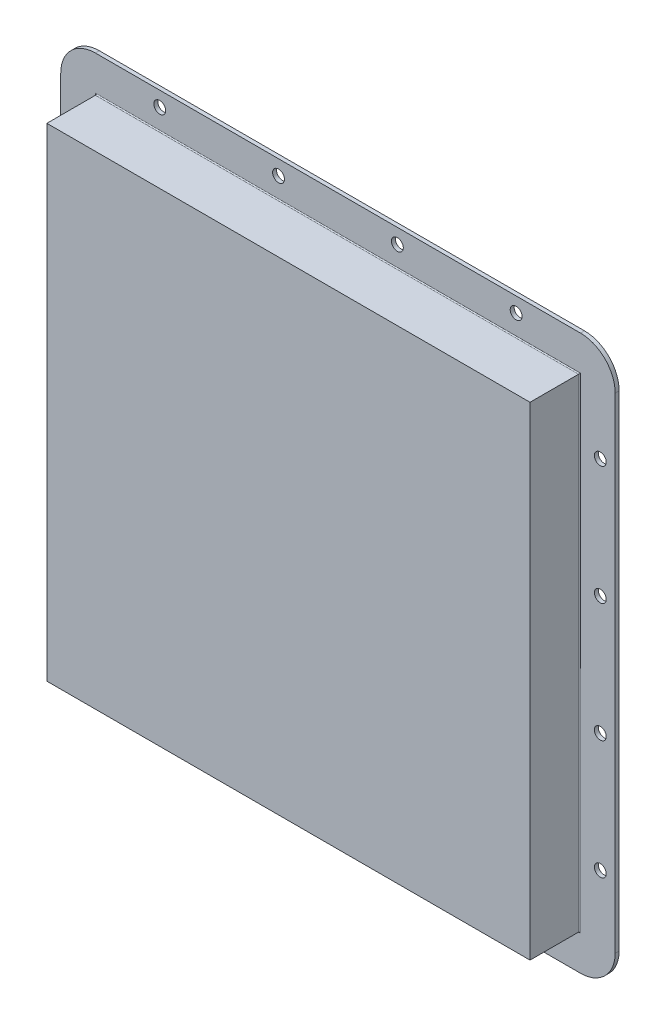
from build123d import *

# Parameters (mm, degrees)
SKETCH1_W           = 488
SKETCH1_H           = 488
BOSS_EXTRUDE1_DEPTH = 4
SKETCH2_W           = 488
SKETCH2_H           = 488
SKETCH2_W_2         = 480
SKETCH2_H_2         = 480
BOSS_EXTRUDE2_DEPTH = 50
SKETCH3_W           = 560
SKETCH3_H           = 560
SKETCH3_W_2         = 488
SKETCH3_H_2         = 488
BOSS_EXTRUDE3_DEPTH = 4
FILLET1_R           = 5
FILLET2_R           = 1
FILLET3_R           = 35
SKETCH4_R           = 6
CUT_EXTRUDE2_DEPTH  = 4
SKETCH6_R           = 5


with BuildPart() as part:
    # Sketch1 → Boss-Extrude1 (new body)
    with BuildSketch(Plane.XY):
        Rectangle(SKETCH1_W, SKETCH1_H)
    extrude(amount=BOSS_EXTRUDE1_DEPTH)

    # Sketch2 → Boss-Extrude2 (add)
    with BuildSketch(Plane(origin=(0, 0, 0), x_dir=(-1, 0, 0), z_dir=(0, 0, -1))):
        Rectangle(SKETCH2_W, SKETCH2_H)
        Rectangle(SKETCH2_W_2, SKETCH2_H_2, mode=Mode.SUBTRACT)
    extrude(amount=BOSS_EXTRUDE2_DEPTH)

    # Sketch3 → Boss-Extrude3 (add)
    with BuildSketch(Plane(origin=(0, 0, -50), x_dir=(-1, 0, 0), z_dir=(0, 0, -1))):
        Rectangle(SKETCH3_W, SKETCH3_H)
        Rectangle(SKETCH3_W_2, SKETCH3_H_2, mode=Mode.SUBTRACT)
    extrude(amount=-BOSS_EXTRUDE3_DEPTH)

    # Fillet1
    fillet1_edges = [part.edges().sort_by_distance(p)[0] for p in [
        (240, 0, -50),
        (0, -240, -50),
        (-240, 0, -50),
        (0, 240, -50),
    ]]
    fillet(fillet1_edges, radius=FILLET1_R)

    # Fillet2
    fillet2_edges = [part.edges().sort_by_distance(p)[0] for p in [
        (0, -244, -46),
        (-244, 0, -46),
        (0, 244, -46),
        (244, 0, -46),
    ]]
    fillet(fillet2_edges, radius=FILLET2_R)

    # Fillet3
    fillet3_edges = [part.edges().sort_by_distance(p)[0] for p in [
        (-280, -280, -48),
        (280, -280, -48),
        (280, 280, -48),
        (-280, 280, -48),
    ]]
    fillet(fillet3_edges, radius=FILLET3_R)

    # Sketch4 → Cut-Extrude2 (cut)
    with BuildSketch(Plane(origin=(0, 0, -50), x_dir=(-1, 0, 0), z_dir=(0, 0, -1))):
        with Locations((180, 265)):
            Circle(SKETCH4_R)
        with Locations((265, 180)):
            Circle(SKETCH4_R)
        with Locations((265, 60)):
            Circle(SKETCH4_R)
        with Locations((265, -60)):
            Circle(SKETCH4_R)
        with Locations((265, -180)):
            Circle(SKETCH4_R)
        with Locations((60, 265)):
            Circle(SKETCH4_R)
        with Locations((-60, 265)):
            Circle(SKETCH4_R)
        with Locations((-180, 265)):
            Circle(SKETCH4_R)
        with Locations((-180, -265)):
            Circle(SKETCH4_R)
        with Locations((-265, -180)):
            Circle(SKETCH4_R)
        with Locations((-265, -60)):
            Circle(SKETCH4_R)
        with Locations((-265, 60)):
            Circle(SKETCH4_R)
        with Locations((-265, 180)):
            Circle(SKETCH4_R)
        with Locations((-60, -265)):
            Circle(SKETCH4_R)
        with Locations((60, -265)):
            Circle(SKETCH4_R)
        with Locations((180, -265)):
            Circle(SKETCH4_R)
    extrude(amount=-CUT_EXTRUDE2_DEPTH, mode=Mode.SUBTRACT)

    # Sweep1: sweep along a path in Sketch5
    with BuildLine(Plane(origin=(0, -120, 0), x_dir=(1, 0, 0), z_dir=(0, 1, 0))) as sweep1_path:
        Line((-75, 0), (-75, 55))
        ThreePointArc((-75, 55), (-70.606601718, 65.606601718), (-60, 70))
        Line((-60, 70), (60, 70))
        ThreePointArc((60, 70), (70.606601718, 65.606601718), (75, 55))
        Line((75, 55), (75, 0))
    # Sketch6 → Sweep1 (sweep)
    with BuildSketch(Plane(origin=(0, 0, 0), x_dir=(-1, 0, 0), z_dir=(0, 0, -1))):
        with Locations((-75, -120)):
            Circle(SKETCH6_R)
    sweep1 = sweep(path=sweep1_path.line)

    # Mirror1: Sweep1 across plane
    add(sweep1.mirror(Plane.ZX))


solid = part.part
